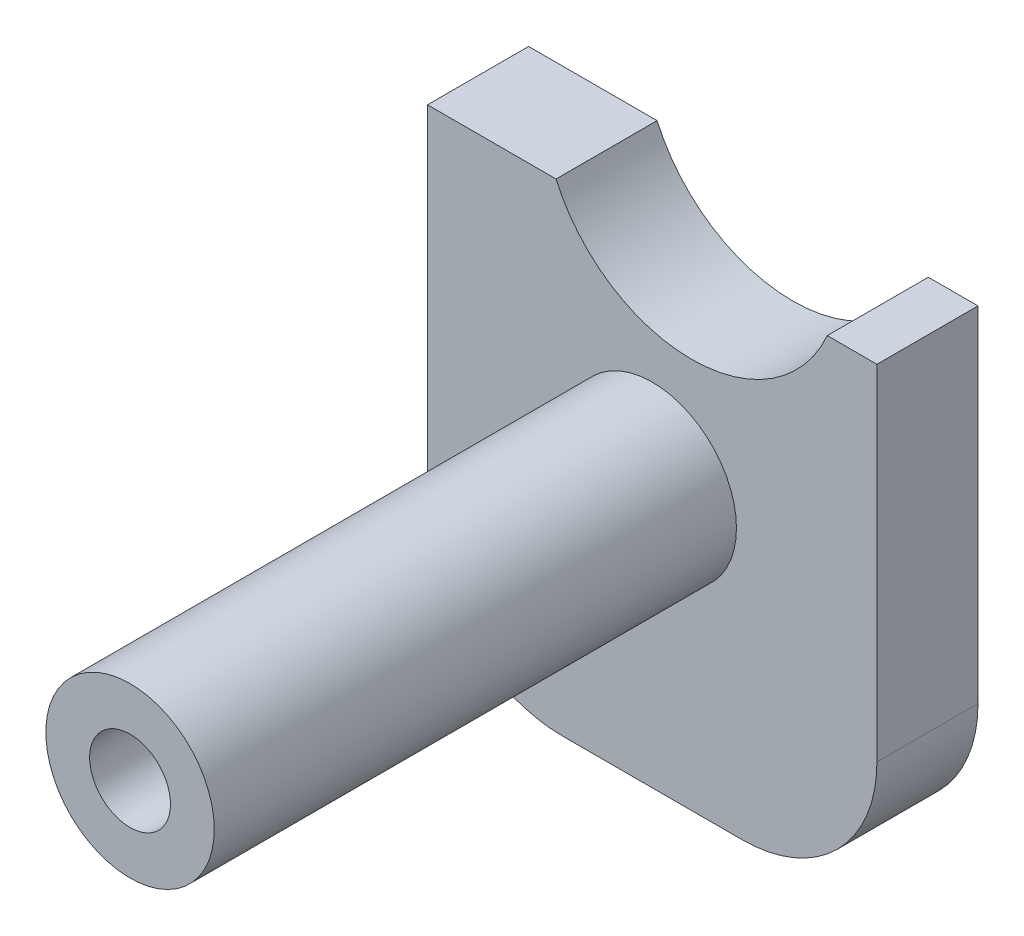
ISO-10303-21;
HEADER;
FILE_DESCRIPTION(('STEP AP214'),'2;1');
FILE_NAME('part.step','',(''),(''),'','','');
FILE_SCHEMA(('AUTOMOTIVE_DESIGN { 1 0 10303 214 1 1 1 1 }'));
ENDSEC;
DATA;
#1=APPLICATION_CONTEXT('core data for automotive mechanical design processes');
#2=APPLICATION_PROTOCOL_DEFINITION('international standard','automotive_design',2000,#1);
#3=PRODUCT_CONTEXT('',#1,'mechanical');
#4=PRODUCT('Part','Part','',(#3));
#5=PRODUCT_RELATED_PRODUCT_CATEGORY('part','',(#4));
#6=PRODUCT_DEFINITION_FORMATION('','',#4);
#7=PRODUCT_DEFINITION_CONTEXT('part definition',#1,'design');
#8=PRODUCT_DEFINITION('design','',#6,#7);
#9=PRODUCT_DEFINITION_SHAPE('','',#8);
#10=(LENGTH_UNIT() NAMED_UNIT(*) SI_UNIT(.MILLI.,.METRE.));
#11=(NAMED_UNIT(*) PLANE_ANGLE_UNIT() SI_UNIT($,.RADIAN.));
#12=(NAMED_UNIT(*) SI_UNIT($,.STERADIAN.) SOLID_ANGLE_UNIT());
#13=UNCERTAINTY_MEASURE_WITH_UNIT(LENGTH_MEASURE(1.E-05),#10,'distance_accuracy_value','');
#14=(GEOMETRIC_REPRESENTATION_CONTEXT(3) GLOBAL_UNCERTAINTY_ASSIGNED_CONTEXT((#13)) GLOBAL_UNIT_ASSIGNED_CONTEXT((#10,
#11,#12)) REPRESENTATION_CONTEXT('',''));
#15=CARTESIAN_POINT('',(0.,0.,0.));
#16=DIRECTION('',(0.,0.,1.));
#17=DIRECTION('',(1.,0.,0.));
#18=AXIS2_PLACEMENT_3D('',#15,#16,#17);
#19=CARTESIAN_POINT('',(26.5,-16.5920931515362,3.));
#20=DIRECTION('',(0.,0.,1.));
#21=DIRECTION('',(1.,0.,0.));
#22=AXIS2_PLACEMENT_3D('',#19,#20,#21);
#23=PLANE('',#22);
#24=CARTESIAN_POINT('',(26.5,-16.5920931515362,3.));
#25=DIRECTION('',(0.,0.,1.));
#26=DIRECTION('',(1.,0.,0.));
#27=AXIS2_PLACEMENT_3D('',#24,#25,#26);
#28=CIRCLE('',#27,4.);
#29=CARTESIAN_POINT('',(26.5,-20.5920931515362,3.));
#30=VERTEX_POINT('',#29);
#31=CARTESIAN_POINT('',(30.5,-16.5920931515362,3.));
#32=VERTEX_POINT('',#31);
#33=EDGE_CURVE('E129',#30,#32,#28,.T.);
#34=ORIENTED_EDGE('',*,*,#33,.T.);
#35=DIRECTION('',(0.,1.,0.));
#36=VECTOR('',#35,1.);
#37=CARTESIAN_POINT('',(30.5,-6.36815944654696,3.));
#38=LINE('',#37,#36);
#39=CARTESIAN_POINT('',(30.5,-6.36815944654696,3.));
#40=VERTEX_POINT('',#39);
#41=EDGE_CURVE('E106',#32,#40,#38,.T.);
#42=ORIENTED_EDGE('',*,*,#41,.T.);
#43=DIRECTION('',(-1.,0.,0.));
#44=VECTOR('',#43,1.);
#45=CARTESIAN_POINT('',(30.5,-6.36815944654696,3.));
#46=LINE('',#45,#44);
#47=CARTESIAN_POINT('',(29.0256165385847,-6.36815944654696,3.));
#48=VERTEX_POINT('',#47);
#49=EDGE_CURVE('E132',#40,#48,#46,.T.);
#50=ORIENTED_EDGE('',*,*,#49,.T.);
#51=CARTESIAN_POINT('',(25.,-4.59209315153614,3.));
#52=DIRECTION('',(0.,0.,-1.));
#53=DIRECTION('',(1.,0.,0.));
#54=AXIS2_PLACEMENT_3D('',#51,#52,#53);
#55=CIRCLE('',#54,4.4);
#56=CARTESIAN_POINT('',(20.9743834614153,-6.36815944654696,3.));
#57=VERTEX_POINT('',#56);
#58=EDGE_CURVE('E134',#48,#57,#55,.T.);
#59=ORIENTED_EDGE('',*,*,#58,.T.);
#60=DIRECTION('',(-1.,0.,0.));
#61=VECTOR('',#60,1.);
#62=CARTESIAN_POINT('',(17.16,-6.36815944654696,3.));
#63=LINE('',#62,#61);
#64=CARTESIAN_POINT('',(17.16,-6.36815944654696,3.));
#65=VERTEX_POINT('',#64);
#66=EDGE_CURVE('E136',#57,#65,#63,.T.);
#67=ORIENTED_EDGE('',*,*,#66,.T.);
#68=DIRECTION('',(0.,-1.,0.));
#69=VECTOR('',#68,1.);
#70=CARTESIAN_POINT('',(17.16,-6.36815944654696,3.));
#71=LINE('',#70,#69);
#72=CARTESIAN_POINT('',(17.16,-16.5920931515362,3.));
#73=VERTEX_POINT('',#72);
#74=EDGE_CURVE('E138',#65,#73,#71,.T.);
#75=ORIENTED_EDGE('',*,*,#74,.T.);
#76=CARTESIAN_POINT('',(21.16,-16.5920931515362,3.));
#77=DIRECTION('',(0.,0.,1.));
#78=DIRECTION('',(-1.,0.,0.));
#79=AXIS2_PLACEMENT_3D('',#76,#77,#78);
#80=CIRCLE('',#79,4.);
#81=CARTESIAN_POINT('',(21.16,-20.5920931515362,3.));
#82=VERTEX_POINT('',#81);
#83=EDGE_CURVE('E47',#73,#82,#80,.T.);
#84=ORIENTED_EDGE('',*,*,#83,.T.);
#85=DIRECTION('',(1.,0.,0.));
#86=VECTOR('',#85,1.);
#87=CARTESIAN_POINT('',(21.16,-20.5920931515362,3.));
#88=LINE('',#87,#86);
#89=EDGE_CURVE('E42',#82,#30,#88,.T.);
#90=ORIENTED_EDGE('',*,*,#89,.T.);
#91=EDGE_LOOP('',(#34,#42,#50,#59,#67,#75,#84,#90));
#92=FACE_BOUND('',#91,.T.);
#93=CARTESIAN_POINT('',(23.83,-12.6620931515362,3.));
#94=DIRECTION('',(0.,0.,1.));
#95=DIRECTION('',(1.,0.,0.));
#96=AXIS2_PLACEMENT_3D('',#93,#94,#95);
#97=CIRCLE('',#96,2.5);
#98=CARTESIAN_POINT('',(26.33,-12.6620931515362,3.));
#99=VERTEX_POINT('',#98);
#100=EDGE_CURVE('E214',#99,#99,#97,.T.);
#101=ORIENTED_EDGE('',*,*,#100,.F.);
#102=EDGE_LOOP('',(#101));
#103=FACE_BOUND('',#102,.T.);
#104=ADVANCED_FACE('F27',(#92,#103),#23,.T.);
#105=CARTESIAN_POINT('',(26.5,-16.5920931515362,0.));
#106=DIRECTION('',(0.,0.,1.));
#107=DIRECTION('',(1.,0.,0.));
#108=AXIS2_PLACEMENT_3D('',#105,#106,#107);
#109=PLANE('',#108);
#110=CARTESIAN_POINT('',(26.5,-16.5920931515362,0.));
#111=DIRECTION('',(0.,0.,1.));
#112=DIRECTION('',(1.,0.,0.));
#113=AXIS2_PLACEMENT_3D('',#110,#111,#112);
#114=CIRCLE('',#113,4.);
#115=CARTESIAN_POINT('',(26.5,-20.5920931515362,0.));
#116=VERTEX_POINT('',#115);
#117=CARTESIAN_POINT('',(30.5,-16.5920931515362,0.));
#118=VERTEX_POINT('',#117);
#119=EDGE_CURVE('E97',#116,#118,#114,.T.);
#120=ORIENTED_EDGE('',*,*,#119,.F.);
#121=DIRECTION('',(1.,0.,0.));
#122=VECTOR('',#121,1.);
#123=CARTESIAN_POINT('',(21.16,-20.5920931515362,0.));
#124=LINE('',#123,#122);
#125=CARTESIAN_POINT('',(21.16,-20.5920931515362,0.));
#126=VERTEX_POINT('',#125);
#127=EDGE_CURVE('E127',#126,#116,#124,.T.);
#128=ORIENTED_EDGE('',*,*,#127,.F.);
#129=CARTESIAN_POINT('',(21.16,-16.5920931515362,0.));
#130=DIRECTION('',(0.,0.,1.));
#131=DIRECTION('',(-1.,0.,0.));
#132=AXIS2_PLACEMENT_3D('',#129,#130,#131);
#133=CIRCLE('',#132,4.);
#134=CARTESIAN_POINT('',(17.16,-16.5920931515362,0.));
#135=VERTEX_POINT('',#134);
#136=EDGE_CURVE('E125',#135,#126,#133,.T.);
#137=ORIENTED_EDGE('',*,*,#136,.F.);
#138=DIRECTION('',(0.,-1.,0.));
#139=VECTOR('',#138,1.);
#140=CARTESIAN_POINT('',(17.16,-6.36815944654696,0.));
#141=LINE('',#140,#139);
#142=CARTESIAN_POINT('',(17.16,-6.36815944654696,0.));
#143=VERTEX_POINT('',#142);
#144=EDGE_CURVE('E123',#143,#135,#141,.T.);
#145=ORIENTED_EDGE('',*,*,#144,.F.);
#146=DIRECTION('',(-1.,0.,0.));
#147=VECTOR('',#146,1.);
#148=CARTESIAN_POINT('',(17.16,-6.36815944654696,0.));
#149=LINE('',#148,#147);
#150=CARTESIAN_POINT('',(20.9743834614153,-6.36815944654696,0.));
#151=VERTEX_POINT('',#150);
#152=EDGE_CURVE('E121',#151,#143,#149,.T.);
#153=ORIENTED_EDGE('',*,*,#152,.F.);
#154=CARTESIAN_POINT('',(25.,-4.59209315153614,0.));
#155=DIRECTION('',(0.,0.,-1.));
#156=DIRECTION('',(1.,0.,0.));
#157=AXIS2_PLACEMENT_3D('',#154,#155,#156);
#158=CIRCLE('',#157,4.4);
#159=CARTESIAN_POINT('',(29.0256165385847,-6.36815944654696,0.));
#160=VERTEX_POINT('',#159);
#161=EDGE_CURVE('E119',#160,#151,#158,.T.);
#162=ORIENTED_EDGE('',*,*,#161,.F.);
#163=DIRECTION('',(-1.,0.,0.));
#164=VECTOR('',#163,1.);
#165=CARTESIAN_POINT('',(30.5,-6.36815944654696,0.));
#166=LINE('',#165,#164);
#167=CARTESIAN_POINT('',(30.5,-6.36815944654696,0.));
#168=VERTEX_POINT('',#167);
#169=EDGE_CURVE('E99',#168,#160,#166,.T.);
#170=ORIENTED_EDGE('',*,*,#169,.F.);
#171=DIRECTION('',(0.,1.,0.));
#172=VECTOR('',#171,1.);
#173=CARTESIAN_POINT('',(30.5,-6.36815944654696,0.));
#174=LINE('',#173,#172);
#175=EDGE_CURVE('E92',#118,#168,#174,.T.);
#176=ORIENTED_EDGE('',*,*,#175,.F.);
#177=EDGE_LOOP('',(#120,#128,#137,#145,#153,#162,#170,#176));
#178=FACE_BOUND('',#177,.T.);
#179=CARTESIAN_POINT('',(23.83,-12.6620931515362,0.));
#180=DIRECTION('',(0.,0.,1.));
#181=DIRECTION('',(1.,0.,0.));
#182=AXIS2_PLACEMENT_3D('',#179,#180,#181);
#183=CIRCLE('',#182,1.2);
#184=CARTESIAN_POINT('',(25.03,-12.6620931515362,0.));
#185=VERTEX_POINT('',#184);
#186=EDGE_CURVE('E111',#185,#185,#183,.T.);
#187=ORIENTED_EDGE('',*,*,#186,.T.);
#188=EDGE_LOOP('',(#187));
#189=FACE_BOUND('',#188,.T.);
#190=ADVANCED_FACE('F93',(#178,#189),#109,.F.);
#191=CARTESIAN_POINT('',(26.5,-16.5920931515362,3.));
#192=DIRECTION('',(0.,0.,-1.));
#193=DIRECTION('',(-1.,0.,0.));
#194=AXIS2_PLACEMENT_3D('',#191,#192,#193);
#195=CYLINDRICAL_SURFACE('',#194,4.);
#196=ORIENTED_EDGE('',*,*,#119,.T.);
#197=DIRECTION('',(0.,0.,-1.));
#198=VECTOR('',#197,1.);
#199=CARTESIAN_POINT('',(30.5,-16.5920931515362,3.));
#200=LINE('',#199,#198);
#201=EDGE_CURVE('E11',#32,#118,#200,.T.);
#202=ORIENTED_EDGE('',*,*,#201,.F.);
#203=ORIENTED_EDGE('',*,*,#33,.F.);
#204=DIRECTION('',(0.,0.,-1.));
#205=VECTOR('',#204,1.);
#206=CARTESIAN_POINT('',(26.5,-20.5920931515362,3.));
#207=LINE('',#206,#205);
#208=EDGE_CURVE('E110',#30,#116,#207,.T.);
#209=ORIENTED_EDGE('',*,*,#208,.T.);
#210=EDGE_LOOP('',(#196,#202,#203,#209));
#211=FACE_BOUND('',#210,.T.);
#212=ADVANCED_FACE('F29',(#211),#195,.T.);
#213=CARTESIAN_POINT('',(30.5,-6.36815944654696,3.));
#214=DIRECTION('',(-1.,0.,0.));
#215=DIRECTION('',(0.,0.,1.));
#216=AXIS2_PLACEMENT_3D('',#213,#214,#215);
#217=PLANE('',#216);
#218=ORIENTED_EDGE('',*,*,#175,.T.);
#219=DIRECTION('',(0.,0.,-1.));
#220=VECTOR('',#219,1.);
#221=CARTESIAN_POINT('',(30.5,-6.36815944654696,3.));
#222=LINE('',#221,#220);
#223=EDGE_CURVE('E35',#40,#168,#222,.T.);
#224=ORIENTED_EDGE('',*,*,#223,.F.);
#225=ORIENTED_EDGE('',*,*,#41,.F.);
#226=ORIENTED_EDGE('',*,*,#201,.T.);
#227=EDGE_LOOP('',(#218,#224,#225,#226));
#228=FACE_BOUND('',#227,.T.);
#229=ADVANCED_FACE('F105',(#228),#217,.F.);
#230=CARTESIAN_POINT('',(30.5,-6.36815944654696,3.));
#231=DIRECTION('',(0.,-1.,0.));
#232=DIRECTION('',(0.,0.,-1.));
#233=AXIS2_PLACEMENT_3D('',#230,#231,#232);
#234=PLANE('',#233);
#235=ORIENTED_EDGE('',*,*,#169,.T.);
#236=DIRECTION('',(0.,0.,-1.));
#237=VECTOR('',#236,1.);
#238=CARTESIAN_POINT('',(29.0256165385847,-6.36815944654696,3.));
#239=LINE('',#238,#237);
#240=EDGE_CURVE('E155',#48,#160,#239,.T.);
#241=ORIENTED_EDGE('',*,*,#240,.F.);
#242=ORIENTED_EDGE('',*,*,#49,.F.);
#243=ORIENTED_EDGE('',*,*,#223,.T.);
#244=EDGE_LOOP('',(#235,#241,#242,#243));
#245=FACE_BOUND('',#244,.T.);
#246=ADVANCED_FACE('F159',(#245),#234,.F.);
#247=CARTESIAN_POINT('',(25.,-4.59209315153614,3.));
#248=DIRECTION('',(0.,0.,-1.));
#249=DIRECTION('',(-1.,0.,0.));
#250=AXIS2_PLACEMENT_3D('',#247,#248,#249);
#251=CYLINDRICAL_SURFACE('',#250,4.4);
#252=ORIENTED_EDGE('',*,*,#161,.T.);
#253=DIRECTION('',(0.,0.,-1.));
#254=VECTOR('',#253,1.);
#255=CARTESIAN_POINT('',(20.9743834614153,-6.36815944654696,3.));
#256=LINE('',#255,#254);
#257=EDGE_CURVE('E152',#57,#151,#256,.T.);
#258=ORIENTED_EDGE('',*,*,#257,.F.);
#259=ORIENTED_EDGE('',*,*,#58,.F.);
#260=ORIENTED_EDGE('',*,*,#240,.T.);
#261=EDGE_LOOP('',(#252,#258,#259,#260));
#262=FACE_BOUND('',#261,.T.);
#263=ADVANCED_FACE('F167',(#262),#251,.F.);
#264=CARTESIAN_POINT('',(17.16,-6.36815944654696,3.));
#265=DIRECTION('',(0.,-1.,0.));
#266=DIRECTION('',(0.,0.,-1.));
#267=AXIS2_PLACEMENT_3D('',#264,#265,#266);
#268=PLANE('',#267);
#269=ORIENTED_EDGE('',*,*,#152,.T.);
#270=DIRECTION('',(0.,0.,-1.));
#271=VECTOR('',#270,1.);
#272=CARTESIAN_POINT('',(17.16,-6.36815944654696,3.));
#273=LINE('',#272,#271);
#274=EDGE_CURVE('E149',#65,#143,#273,.T.);
#275=ORIENTED_EDGE('',*,*,#274,.F.);
#276=ORIENTED_EDGE('',*,*,#66,.F.);
#277=ORIENTED_EDGE('',*,*,#257,.T.);
#278=EDGE_LOOP('',(#269,#275,#276,#277));
#279=FACE_BOUND('',#278,.T.);
#280=ADVANCED_FACE('F170',(#279),#268,.F.);
#281=CARTESIAN_POINT('',(17.16,-6.36815944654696,3.));
#282=DIRECTION('',(1.,0.,0.));
#283=DIRECTION('',(0.,0.,-1.));
#284=AXIS2_PLACEMENT_3D('',#281,#282,#283);
#285=PLANE('',#284);
#286=ORIENTED_EDGE('',*,*,#144,.T.);
#287=DIRECTION('',(0.,0.,-1.));
#288=VECTOR('',#287,1.);
#289=CARTESIAN_POINT('',(17.16,-16.5920931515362,3.));
#290=LINE('',#289,#288);
#291=EDGE_CURVE('E146',#73,#135,#290,.T.);
#292=ORIENTED_EDGE('',*,*,#291,.F.);
#293=ORIENTED_EDGE('',*,*,#74,.F.);
#294=ORIENTED_EDGE('',*,*,#274,.T.);
#295=EDGE_LOOP('',(#286,#292,#293,#294));
#296=FACE_BOUND('',#295,.T.);
#297=ADVANCED_FACE('F175',(#296),#285,.F.);
#298=CARTESIAN_POINT('',(21.16,-16.5920931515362,3.));
#299=DIRECTION('',(0.,0.,-1.));
#300=DIRECTION('',(-1.,0.,0.));
#301=AXIS2_PLACEMENT_3D('',#298,#299,#300);
#302=CYLINDRICAL_SURFACE('',#301,4.);
#303=ORIENTED_EDGE('',*,*,#136,.T.);
#304=DIRECTION('',(0.,0.,-1.));
#305=VECTOR('',#304,1.);
#306=CARTESIAN_POINT('',(21.16,-20.5920931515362,3.));
#307=LINE('',#306,#305);
#308=EDGE_CURVE('E143',#82,#126,#307,.T.);
#309=ORIENTED_EDGE('',*,*,#308,.F.);
#310=ORIENTED_EDGE('',*,*,#83,.F.);
#311=ORIENTED_EDGE('',*,*,#291,.T.);
#312=EDGE_LOOP('',(#303,#309,#310,#311));
#313=FACE_BOUND('',#312,.T.);
#314=ADVANCED_FACE('F178',(#313),#302,.T.);
#315=CARTESIAN_POINT('',(21.16,-20.5920931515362,3.));
#316=DIRECTION('',(0.,1.,0.));
#317=DIRECTION('',(0.,0.,1.));
#318=AXIS2_PLACEMENT_3D('',#315,#316,#317);
#319=PLANE('',#318);
#320=ORIENTED_EDGE('',*,*,#127,.T.);
#321=ORIENTED_EDGE('',*,*,#208,.F.);
#322=ORIENTED_EDGE('',*,*,#89,.F.);
#323=ORIENTED_EDGE('',*,*,#308,.T.);
#324=EDGE_LOOP('',(#320,#321,#322,#323));
#325=FACE_BOUND('',#324,.T.);
#326=ADVANCED_FACE('F180',(#325),#319,.F.);
#327=CARTESIAN_POINT('',(23.83,-12.6620931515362,3.));
#328=DIRECTION('',(0.,0.,-1.));
#329=DIRECTION('',(-1.,0.,0.));
#330=AXIS2_PLACEMENT_3D('',#327,#328,#329);
#331=CYLINDRICAL_SURFACE('',#330,1.2);
#332=ORIENTED_EDGE('',*,*,#186,.F.);
#333=EDGE_LOOP('',(#332));
#334=FACE_BOUND('',#333,.T.);
#335=CARTESIAN_POINT('',(23.83,-12.6620931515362,18.5));
#336=DIRECTION('',(0.,0.,1.));
#337=DIRECTION('',(1.,0.,0.));
#338=AXIS2_PLACEMENT_3D('',#335,#336,#337);
#339=CIRCLE('',#338,1.2);
#340=CARTESIAN_POINT('',(25.03,-12.6620931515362,18.5));
#341=VERTEX_POINT('',#340);
#342=EDGE_CURVE('E212',#341,#341,#339,.T.);
#343=ORIENTED_EDGE('',*,*,#342,.T.);
#344=EDGE_LOOP('',(#343));
#345=FACE_BOUND('',#344,.T.);
#346=ADVANCED_FACE('F182',(#334,#345),#331,.F.);
#347=CARTESIAN_POINT('',(23.83,-12.6620931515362,18.5));
#348=DIRECTION('',(0.,0.,1.));
#349=DIRECTION('',(1.,0.,0.));
#350=AXIS2_PLACEMENT_3D('',#347,#348,#349);
#351=PLANE('',#350);
#352=CARTESIAN_POINT('',(23.83,-12.6620931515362,18.5));
#353=DIRECTION('',(0.,0.,1.));
#354=DIRECTION('',(1.,0.,0.));
#355=AXIS2_PLACEMENT_3D('',#352,#353,#354);
#356=CIRCLE('',#355,2.5);
#357=CARTESIAN_POINT('',(26.33,-12.6620931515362,18.5));
#358=VERTEX_POINT('',#357);
#359=EDGE_CURVE('E114',#358,#358,#356,.T.);
#360=ORIENTED_EDGE('',*,*,#359,.T.);
#361=EDGE_LOOP('',(#360));
#362=FACE_BOUND('',#361,.T.);
#363=ORIENTED_EDGE('',*,*,#342,.F.);
#364=EDGE_LOOP('',(#363));
#365=FACE_BOUND('',#364,.T.);
#366=ADVANCED_FACE('F189',(#362,#365),#351,.T.);
#367=CARTESIAN_POINT('',(23.83,-12.6620931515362,18.5));
#368=DIRECTION('',(0.,0.,-1.));
#369=DIRECTION('',(-1.,0.,0.));
#370=AXIS2_PLACEMENT_3D('',#367,#368,#369);
#371=CYLINDRICAL_SURFACE('',#370,2.5);
#372=ORIENTED_EDGE('',*,*,#359,.F.);
#373=EDGE_LOOP('',(#372));
#374=FACE_BOUND('',#373,.T.);
#375=ORIENTED_EDGE('',*,*,#100,.T.);
#376=EDGE_LOOP('',(#375));
#377=FACE_BOUND('',#376,.T.);
#378=ADVANCED_FACE('F199',(#374,#377),#371,.T.);
#379=CLOSED_SHELL('',(#104,#190,#212,#229,#246,#263,#280,#297,#314,#326,#346,#366,#378));
#380=MANIFOLD_SOLID_BREP('B2',#379);
#381=ADVANCED_BREP_SHAPE_REPRESENTATION('',(#18,#380),#14);
#382=SHAPE_DEFINITION_REPRESENTATION(#9,#381);
ENDSEC;
END-ISO-10303-21;
